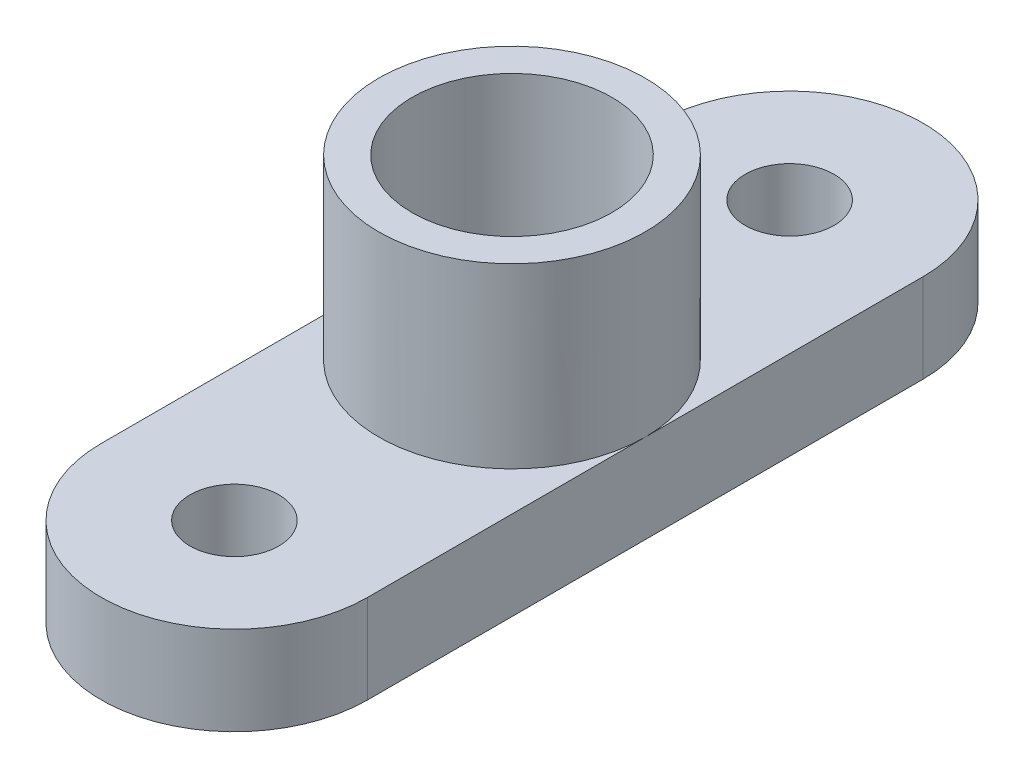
ISO-10303-21;
HEADER;
FILE_DESCRIPTION(('STEP AP214'),'2;1');
FILE_NAME('part.step','',(''),(''),'','','');
FILE_SCHEMA(('AUTOMOTIVE_DESIGN { 1 0 10303 214 1 1 1 1 }'));
ENDSEC;
DATA;
#1=APPLICATION_CONTEXT('core data for automotive mechanical design processes');
#2=APPLICATION_PROTOCOL_DEFINITION('international standard','automotive_design',2000,#1);
#3=PRODUCT_CONTEXT('',#1,'mechanical');
#4=PRODUCT('Part','Part','',(#3));
#5=PRODUCT_RELATED_PRODUCT_CATEGORY('part','',(#4));
#6=PRODUCT_DEFINITION_FORMATION('','',#4);
#7=PRODUCT_DEFINITION_CONTEXT('part definition',#1,'design');
#8=PRODUCT_DEFINITION('design','',#6,#7);
#9=PRODUCT_DEFINITION_SHAPE('','',#8);
#10=(LENGTH_UNIT() NAMED_UNIT(*) SI_UNIT(.MILLI.,.METRE.));
#11=(NAMED_UNIT(*) PLANE_ANGLE_UNIT() SI_UNIT($,.RADIAN.));
#12=(NAMED_UNIT(*) SI_UNIT($,.STERADIAN.) SOLID_ANGLE_UNIT());
#13=UNCERTAINTY_MEASURE_WITH_UNIT(LENGTH_MEASURE(1.E-05),#10,'distance_accuracy_value','');
#14=(GEOMETRIC_REPRESENTATION_CONTEXT(3) GLOBAL_UNCERTAINTY_ASSIGNED_CONTEXT((#13)) GLOBAL_UNIT_ASSIGNED_CONTEXT((#10,
#11,#12)) REPRESENTATION_CONTEXT('',''));
#15=CARTESIAN_POINT('',(0.,0.,0.));
#16=DIRECTION('',(0.,0.,1.));
#17=DIRECTION('',(1.,0.,0.));
#18=AXIS2_PLACEMENT_3D('',#15,#16,#17);
#19=CARTESIAN_POINT('',(0.,16.,0.));
#20=DIRECTION('',(0.,-1.,0.));
#21=DIRECTION('',(0.,0.,-1.));
#22=AXIS2_PLACEMENT_3D('',#19,#20,#21);
#23=CYLINDRICAL_SURFACE('',#22,12.);
#24=CARTESIAN_POINT('',(0.,16.,0.));
#25=DIRECTION('',(0.,1.,0.));
#26=DIRECTION('',(0.,0.,1.));
#27=AXIS2_PLACEMENT_3D('',#24,#25,#26);
#28=CIRCLE('',#27,12.);
#29=CARTESIAN_POINT('',(0.,16.,12.));
#30=VERTEX_POINT('',#29);
#31=EDGE_CURVE('E11',#30,#30,#28,.T.);
#32=ORIENTED_EDGE('',*,*,#31,.F.);
#33=EDGE_LOOP('',(#32));
#34=FACE_BOUND('',#33,.T.);
#35=CARTESIAN_POINT('',(0.,0.,0.));
#36=DIRECTION('',(0.,1.,0.));
#37=DIRECTION('',(0.,0.,1.));
#38=AXIS2_PLACEMENT_3D('',#35,#36,#37);
#39=CIRCLE('',#38,12.);
#40=CARTESIAN_POINT('',(12.,0.,0.));
#41=VERTEX_POINT('',#40);
#42=CARTESIAN_POINT('',(-12.,0.,0.));
#43=VERTEX_POINT('',#42);
#44=EDGE_CURVE('E355',#41,#43,#39,.T.);
#45=ORIENTED_EDGE('',*,*,#44,.T.);
#46=EDGE_CURVE('E369',#43,#41,#39,.T.);
#47=ORIENTED_EDGE('',*,*,#46,.T.);
#48=EDGE_LOOP('',(#45,#47));
#49=FACE_BOUND('',#48,.T.);
#50=ADVANCED_FACE('F348',(#34,#49),#23,.T.);
#51=CARTESIAN_POINT('',(0.,16.,0.));
#52=DIRECTION('',(0.,1.,0.));
#53=DIRECTION('',(0.,0.,1.));
#54=AXIS2_PLACEMENT_3D('',#51,#52,#53);
#55=PLANE('',#54);
#56=CARTESIAN_POINT('',(0.,16.,0.));
#57=DIRECTION('',(0.,1.,0.));
#58=DIRECTION('',(0.,0.,1.));
#59=AXIS2_PLACEMENT_3D('',#56,#57,#58);
#60=CIRCLE('',#59,9.);
#61=CARTESIAN_POINT('',(0.,16.,9.));
#62=VERTEX_POINT('',#61);
#63=EDGE_CURVE('E493',#62,#62,#60,.T.);
#64=ORIENTED_EDGE('',*,*,#63,.F.);
#65=EDGE_LOOP('',(#64));
#66=FACE_BOUND('',#65,.T.);
#67=ORIENTED_EDGE('',*,*,#31,.T.);
#68=EDGE_LOOP('',(#67));
#69=FACE_BOUND('',#68,.T.);
#70=ADVANCED_FACE('F443',(#66,#69),#55,.T.);
#71=CARTESIAN_POINT('',(0.,0.,25.));
#72=DIRECTION('',(0.,-1.,0.));
#73=DIRECTION('',(0.,0.,-1.));
#74=AXIS2_PLACEMENT_3D('',#71,#72,#73);
#75=PLANE('',#74);
#76=ORIENTED_EDGE('',*,*,#44,.F.);
#77=DIRECTION('',(0.,0.,1.));
#78=VECTOR('',#77,1.);
#79=CARTESIAN_POINT('',(12.,0.,25.));
#80=LINE('',#79,#78);
#81=CARTESIAN_POINT('',(12.,0.,-25.));
#82=VERTEX_POINT('',#81);
#83=EDGE_CURVE('E362',#82,#41,#80,.T.);
#84=ORIENTED_EDGE('',*,*,#83,.F.);
#85=CARTESIAN_POINT('',(0.,0.,-25.));
#86=DIRECTION('',(0.,-1.,0.));
#87=DIRECTION('',(0.,0.,-1.));
#88=AXIS2_PLACEMENT_3D('',#85,#86,#87);
#89=CIRCLE('',#88,12.);
#90=CARTESIAN_POINT('',(-12.,0.,-25.));
#91=VERTEX_POINT('',#90);
#92=EDGE_CURVE('E402',#91,#82,#89,.T.);
#93=ORIENTED_EDGE('',*,*,#92,.F.);
#94=DIRECTION('',(0.,0.,-1.));
#95=VECTOR('',#94,1.);
#96=CARTESIAN_POINT('',(-12.,0.,-25.));
#97=LINE('',#96,#95);
#98=EDGE_CURVE('E403',#43,#91,#97,.T.);
#99=ORIENTED_EDGE('',*,*,#98,.F.);
#100=EDGE_LOOP('',(#76,#84,#93,#99));
#101=FACE_BOUND('',#100,.T.);
#102=CARTESIAN_POINT('',(0.,0.,-25.));
#103=DIRECTION('',(0.,-1.,0.));
#104=DIRECTION('',(0.,0.,-1.));
#105=AXIS2_PLACEMENT_3D('',#102,#103,#104);
#106=CIRCLE('',#105,4.);
#107=CARTESIAN_POINT('',(0.,0.,-29.));
#108=VERTEX_POINT('',#107);
#109=EDGE_CURVE('E422',#108,#108,#106,.T.);
#110=ORIENTED_EDGE('',*,*,#109,.T.);
#111=EDGE_LOOP('',(#110));
#112=FACE_BOUND('',#111,.T.);
#113=ADVANCED_FACE('F449',(#101,#112),#75,.F.);
#114=CARTESIAN_POINT('',(0.,-8.,25.));
#115=DIRECTION('',(0.,-1.,0.));
#116=DIRECTION('',(0.,0.,-1.));
#117=AXIS2_PLACEMENT_3D('',#114,#115,#116);
#118=PLANE('',#117);
#119=CARTESIAN_POINT('',(0.,-8.,0.));
#120=DIRECTION('',(0.,1.,0.));
#121=DIRECTION('',(0.,0.,1.));
#122=AXIS2_PLACEMENT_3D('',#119,#120,#121);
#123=CIRCLE('',#122,9.);
#124=CARTESIAN_POINT('',(0.,-8.,9.));
#125=VERTEX_POINT('',#124);
#126=EDGE_CURVE('E491',#125,#125,#123,.T.);
#127=ORIENTED_EDGE('',*,*,#126,.T.);
#128=EDGE_LOOP('',(#127));
#129=FACE_BOUND('',#128,.T.);
#130=CARTESIAN_POINT('',(0.,-8.,-25.));
#131=DIRECTION('',(0.,-1.,0.));
#132=DIRECTION('',(0.,0.,-1.));
#133=AXIS2_PLACEMENT_3D('',#130,#131,#132);
#134=CIRCLE('',#133,4.);
#135=CARTESIAN_POINT('',(0.,-8.,-29.));
#136=VERTEX_POINT('',#135);
#137=EDGE_CURVE('E419',#136,#136,#134,.T.);
#138=ORIENTED_EDGE('',*,*,#137,.F.);
#139=EDGE_LOOP('',(#138));
#140=FACE_BOUND('',#139,.T.);
#141=CARTESIAN_POINT('',(0.,-8.,25.));
#142=DIRECTION('',(0.,-1.,0.));
#143=DIRECTION('',(0.,0.,-1.));
#144=AXIS2_PLACEMENT_3D('',#141,#142,#143);
#145=CIRCLE('',#144,12.);
#146=CARTESIAN_POINT('',(12.,-8.,25.));
#147=VERTEX_POINT('',#146);
#148=CARTESIAN_POINT('',(-12.,-8.,25.));
#149=VERTEX_POINT('',#148);
#150=EDGE_CURVE('E429',#147,#149,#145,.T.);
#151=ORIENTED_EDGE('',*,*,#150,.T.);
#152=DIRECTION('',(0.,0.,-1.));
#153=VECTOR('',#152,1.);
#154=CARTESIAN_POINT('',(-12.,-8.,-25.));
#155=LINE('',#154,#153);
#156=CARTESIAN_POINT('',(-12.,-8.,-25.));
#157=VERTEX_POINT('',#156);
#158=EDGE_CURVE('E409',#149,#157,#155,.T.);
#159=ORIENTED_EDGE('',*,*,#158,.T.);
#160=CARTESIAN_POINT('',(0.,-8.,-25.));
#161=DIRECTION('',(0.,-1.,0.));
#162=DIRECTION('',(0.,0.,-1.));
#163=AXIS2_PLACEMENT_3D('',#160,#161,#162);
#164=CIRCLE('',#163,12.);
#165=CARTESIAN_POINT('',(12.,-8.,-25.));
#166=VERTEX_POINT('',#165);
#167=EDGE_CURVE('E432',#157,#166,#164,.T.);
#168=ORIENTED_EDGE('',*,*,#167,.T.);
#169=DIRECTION('',(0.,0.,1.));
#170=VECTOR('',#169,1.);
#171=CARTESIAN_POINT('',(12.,-8.,25.));
#172=LINE('',#171,#170);
#173=EDGE_CURVE('E434',#166,#147,#172,.T.);
#174=ORIENTED_EDGE('',*,*,#173,.T.);
#175=EDGE_LOOP('',(#151,#159,#168,#174));
#176=FACE_BOUND('',#175,.T.);
#177=CARTESIAN_POINT('',(0.,-8.,25.));
#178=DIRECTION('',(0.,-1.,0.));
#179=DIRECTION('',(0.,0.,-1.));
#180=AXIS2_PLACEMENT_3D('',#177,#178,#179);
#181=CIRCLE('',#180,4.);
#182=CARTESIAN_POINT('',(0.,-8.,21.));
#183=VERTEX_POINT('',#182);
#184=EDGE_CURVE('E500',#183,#183,#181,.T.);
#185=ORIENTED_EDGE('',*,*,#184,.F.);
#186=EDGE_LOOP('',(#185));
#187=FACE_BOUND('',#186,.T.);
#188=ADVANCED_FACE('F457',(#129,#140,#176,#187),#118,.T.);
#189=ORIENTED_EDGE('',*,*,#46,.F.);
#190=CARTESIAN_POINT('',(-12.,0.,25.));
#191=VERTEX_POINT('',#190);
#192=EDGE_CURVE('E394',#191,#43,#97,.T.);
#193=ORIENTED_EDGE('',*,*,#192,.F.);
#194=CARTESIAN_POINT('',(0.,0.,25.));
#195=DIRECTION('',(0.,-1.,0.));
#196=DIRECTION('',(0.,0.,-1.));
#197=AXIS2_PLACEMENT_3D('',#194,#195,#196);
#198=CIRCLE('',#197,12.);
#199=CARTESIAN_POINT('',(12.,0.,25.));
#200=VERTEX_POINT('',#199);
#201=EDGE_CURVE('E399',#200,#191,#198,.T.);
#202=ORIENTED_EDGE('',*,*,#201,.F.);
#203=EDGE_CURVE('E427',#41,#200,#80,.T.);
#204=ORIENTED_EDGE('',*,*,#203,.F.);
#205=EDGE_LOOP('',(#189,#193,#202,#204));
#206=FACE_BOUND('',#205,.T.);
#207=CARTESIAN_POINT('',(0.,0.,25.));
#208=DIRECTION('',(0.,-1.,0.));
#209=DIRECTION('',(0.,0.,-1.));
#210=AXIS2_PLACEMENT_3D('',#207,#208,#209);
#211=CIRCLE('',#210,4.);
#212=CARTESIAN_POINT('',(0.,0.,21.));
#213=VERTEX_POINT('',#212);
#214=EDGE_CURVE('E495',#213,#213,#211,.T.);
#215=ORIENTED_EDGE('',*,*,#214,.T.);
#216=EDGE_LOOP('',(#215));
#217=FACE_BOUND('',#216,.T.);
#218=ADVANCED_FACE('F396',(#206,#217),#75,.F.);
#219=CARTESIAN_POINT('',(0.,-8.,25.));
#220=DIRECTION('',(0.,1.,0.));
#221=DIRECTION('',(0.,0.,1.));
#222=AXIS2_PLACEMENT_3D('',#219,#220,#221);
#223=CYLINDRICAL_SURFACE('',#222,12.);
#224=ORIENTED_EDGE('',*,*,#201,.T.);
#225=DIRECTION('',(0.,1.,0.));
#226=VECTOR('',#225,1.);
#227=CARTESIAN_POINT('',(-12.,-8.,25.));
#228=LINE('',#227,#226);
#229=EDGE_CURVE('E406',#149,#191,#228,.T.);
#230=ORIENTED_EDGE('',*,*,#229,.F.);
#231=ORIENTED_EDGE('',*,*,#150,.F.);
#232=DIRECTION('',(0.,1.,0.));
#233=VECTOR('',#232,1.);
#234=CARTESIAN_POINT('',(12.,-8.,25.));
#235=LINE('',#234,#233);
#236=EDGE_CURVE('E418',#147,#200,#235,.T.);
#237=ORIENTED_EDGE('',*,*,#236,.T.);
#238=EDGE_LOOP('',(#224,#230,#231,#237));
#239=FACE_BOUND('',#238,.T.);
#240=ADVANCED_FACE('F416',(#239),#223,.T.);
#241=CARTESIAN_POINT('',(-12.,-8.,-25.));
#242=DIRECTION('',(1.,0.,0.));
#243=DIRECTION('',(0.,0.,-1.));
#244=AXIS2_PLACEMENT_3D('',#241,#242,#243);
#245=PLANE('',#244);
#246=ORIENTED_EDGE('',*,*,#192,.T.);
#247=ORIENTED_EDGE('',*,*,#98,.T.);
#248=DIRECTION('',(0.,1.,0.));
#249=VECTOR('',#248,1.);
#250=CARTESIAN_POINT('',(-12.,-8.,-25.));
#251=LINE('',#250,#249);
#252=EDGE_CURVE('E413',#157,#91,#251,.T.);
#253=ORIENTED_EDGE('',*,*,#252,.F.);
#254=ORIENTED_EDGE('',*,*,#158,.F.);
#255=ORIENTED_EDGE('',*,*,#229,.T.);
#256=EDGE_LOOP('',(#246,#247,#253,#254,#255));
#257=FACE_BOUND('',#256,.T.);
#258=ADVANCED_FACE('F407',(#257),#245,.F.);
#259=CARTESIAN_POINT('',(0.,-8.,-25.));
#260=DIRECTION('',(0.,1.,0.));
#261=DIRECTION('',(0.,0.,1.));
#262=AXIS2_PLACEMENT_3D('',#259,#260,#261);
#263=CYLINDRICAL_SURFACE('',#262,12.);
#264=ORIENTED_EDGE('',*,*,#92,.T.);
#265=DIRECTION('',(0.,1.,0.));
#266=VECTOR('',#265,1.);
#267=CARTESIAN_POINT('',(12.,-8.,-25.));
#268=LINE('',#267,#266);
#269=EDGE_CURVE('E437',#166,#82,#268,.T.);
#270=ORIENTED_EDGE('',*,*,#269,.F.);
#271=ORIENTED_EDGE('',*,*,#167,.F.);
#272=ORIENTED_EDGE('',*,*,#252,.T.);
#273=EDGE_LOOP('',(#264,#270,#271,#272));
#274=FACE_BOUND('',#273,.T.);
#275=ADVANCED_FACE('F466',(#274),#263,.T.);
#276=CARTESIAN_POINT('',(12.,-8.,25.));
#277=DIRECTION('',(-1.,0.,0.));
#278=DIRECTION('',(0.,0.,1.));
#279=AXIS2_PLACEMENT_3D('',#276,#277,#278);
#280=PLANE('',#279);
#281=ORIENTED_EDGE('',*,*,#83,.T.);
#282=ORIENTED_EDGE('',*,*,#203,.T.);
#283=ORIENTED_EDGE('',*,*,#236,.F.);
#284=ORIENTED_EDGE('',*,*,#173,.F.);
#285=ORIENTED_EDGE('',*,*,#269,.T.);
#286=EDGE_LOOP('',(#281,#282,#283,#284,#285));
#287=FACE_BOUND('',#286,.T.);
#288=ADVANCED_FACE('F469',(#287),#280,.F.);
#289=CARTESIAN_POINT('',(0.,-8.,-25.));
#290=DIRECTION('',(0.,1.,0.));
#291=DIRECTION('',(0.,0.,1.));
#292=AXIS2_PLACEMENT_3D('',#289,#290,#291);
#293=CYLINDRICAL_SURFACE('',#292,4.);
#294=ORIENTED_EDGE('',*,*,#137,.T.);
#295=EDGE_LOOP('',(#294));
#296=FACE_BOUND('',#295,.T.);
#297=ORIENTED_EDGE('',*,*,#109,.F.);
#298=EDGE_LOOP('',(#297));
#299=FACE_BOUND('',#298,.T.);
#300=ADVANCED_FACE('F473',(#296,#299),#293,.F.);
#301=CARTESIAN_POINT('',(0.,-8.,25.));
#302=DIRECTION('',(0.,1.,0.));
#303=DIRECTION('',(0.,0.,1.));
#304=AXIS2_PLACEMENT_3D('',#301,#302,#303);
#305=CYLINDRICAL_SURFACE('',#304,4.);
#306=ORIENTED_EDGE('',*,*,#184,.T.);
#307=EDGE_LOOP('',(#306));
#308=FACE_BOUND('',#307,.T.);
#309=ORIENTED_EDGE('',*,*,#214,.F.);
#310=EDGE_LOOP('',(#309));
#311=FACE_BOUND('',#310,.T.);
#312=ADVANCED_FACE('F479',(#308,#311),#305,.F.);
#313=CARTESIAN_POINT('',(0.,-8.,0.));
#314=DIRECTION('',(0.,1.,0.));
#315=DIRECTION('',(0.,0.,1.));
#316=AXIS2_PLACEMENT_3D('',#313,#314,#315);
#317=CYLINDRICAL_SURFACE('',#316,9.);
#318=ORIENTED_EDGE('',*,*,#126,.F.);
#319=EDGE_LOOP('',(#318));
#320=FACE_BOUND('',#319,.T.);
#321=ORIENTED_EDGE('',*,*,#63,.T.);
#322=EDGE_LOOP('',(#321));
#323=FACE_BOUND('',#322,.T.);
#324=ADVANCED_FACE('F482',(#320,#323),#317,.F.);
#325=CLOSED_SHELL('',(#50,#70,#113,#188,#218,#240,#258,#275,#288,#300,#312,#324));
#326=MANIFOLD_SOLID_BREP('B2',#325);
#327=ADVANCED_BREP_SHAPE_REPRESENTATION('',(#18,#326),#14);
#328=SHAPE_DEFINITION_REPRESENTATION(#9,#327);
ENDSEC;
END-ISO-10303-21;
